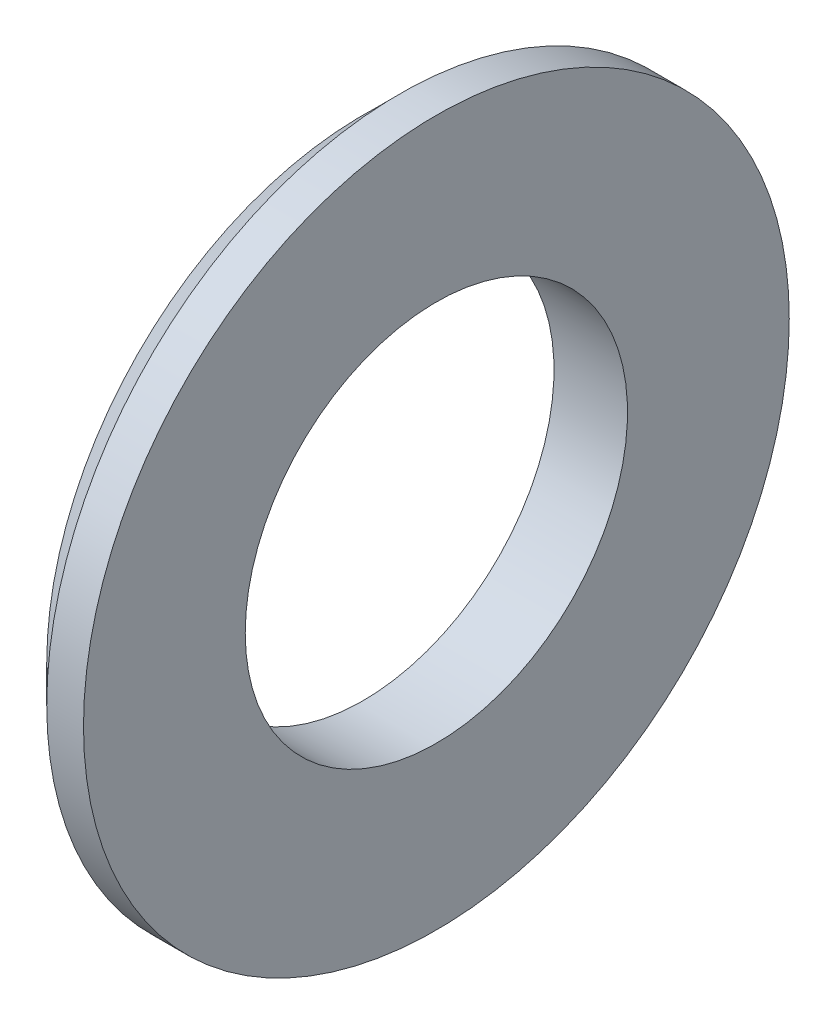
from build123d import *


with BuildPart() as part:
    # Sketch1 → Base-Revolve (revolve)
    with BuildSketch(Plane.XY, mode=Mode.PRIVATE) as base_revolve_sk:
        Polygon((0, 6.5), (0, 12), (-1.25, 12), (-2.5, 10.75), (-2.5, 6.5), align=None)
    revolve(base_revolve_sk.sketch.rotate(Axis((-34.925, 0, 0), (1, 0, 0)), 90), axis=Axis((-34.925, 0, 0), (1, 0, 0)))


solid = part.part
